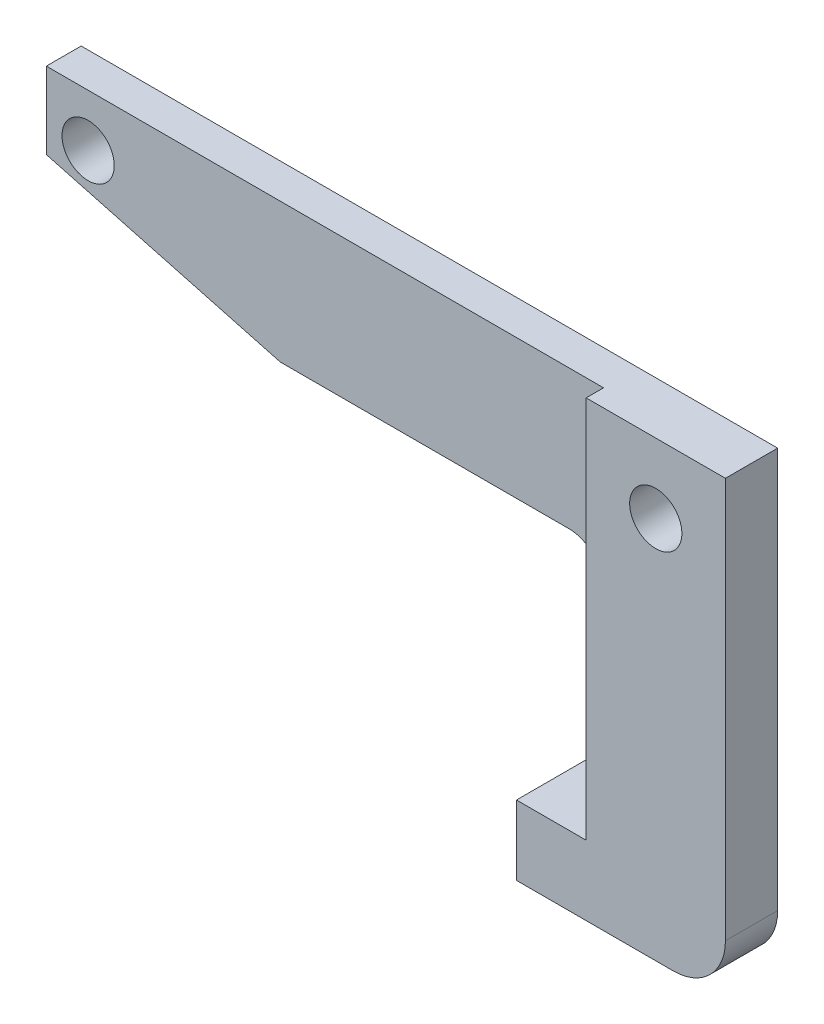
from build123d import *

# Parameters (mm, degrees)
BASE_EXTRUDE_DEPTH = 12.7
SKETCH2_R          = 4.7625
CUT_EXTRUDE1_DEPTH = 135.554087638
SKETCH3_R          = 4.7625
CUT_EXTRUDE2_DEPTH = 135.554087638
CHAMFER1_SIZE      = 11.43
CHAMFER1_SIZE2     = 42.657340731
SKETCH4_W          = 101.6
SKETCH4_H          = 25.4
CUT_EXTRUDE3_DEPTH = 3.175
FILLET1_R          = 9.525
FILLET2_R          = 6.35
CHAMFER2_SIZE      = 3.175
SKETCH5_R          = 9.525
CUT_EXTRUDE4_DEPTH = 4.445


with BuildPart() as part:
    # Sketch1 → Base-Extrude (new body)
    with BuildSketch(Plane.XY):
        Polygon((-114.3, 12.7), (12.7, 12.7), (12.7, -69.85), (-25.4, -69.85), (-25.4, -57.15), (-12.7, -57.15), (-12.7, -12.7), (-114.3, -12.7), align=None)
    extrude(amount=BASE_EXTRUDE_DEPTH)

    # Sketch2 → Cut-Extrude1 (cut, through all)
    with BuildSketch(Plane.XY.offset(12.7)):
        Circle(SKETCH2_R)
    extrude(amount=-CUT_EXTRUDE1_DEPTH, mode=Mode.SUBTRACT)

    # Sketch3 → Cut-Extrude2 (cut, through all)
    with BuildSketch(Plane.XY.offset(12.7)):
        with Locations((-106.68, 3.175)):
            Circle(SKETCH3_R)
    extrude(amount=-CUT_EXTRUDE2_DEPTH, mode=Mode.SUBTRACT)

    # Chamfer1
    chamfer1_edges = [part.edges().sort_by_distance(p)[0] for p in [
        (-114.3, -12.7, 6.35),
    ]]
    chamfer1_side = [part.faces().sort_by_distance(p)[0] for p in [
        (-114.3, 0, 6.35),
    ]]
    chamfer(chamfer1_edges, length=CHAMFER1_SIZE, length2=CHAMFER1_SIZE2, reference=chamfer1_side[0])

    # Sketch4 → Cut-Extrude3 (cut)
    with BuildSketch(Plane.XY.offset(12.7)):
        with Locations((-63.5, 0)):
            Rectangle(SKETCH4_W, SKETCH4_H)
    extrude(amount=-CUT_EXTRUDE3_DEPTH, mode=Mode.SUBTRACT)

    # Fillet1
    fillet1_edges = [part.edges().sort_by_distance(p)[0] for p in [
        (12.7, -69.85, 6.35),
    ]]
    fillet(fillet1_edges, radius=FILLET1_R)

    # Fillet2
    fillet2_edges = [part.edges().sort_by_distance(p)[0] for p in [
        (-12.7, -12.7, 4.7625),
    ]]
    fillet(fillet2_edges, radius=FILLET2_R)

    # Chamfer2
    chamfer2_edges = [part.edges().sort_by_distance(p)[0] for p in [
        (12.7, -23.8125, 0),
        (9.910192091, -67.060192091, 0),
        (-50.8, 12.7, 0),
        (-11.1125, -69.85, 0),
    ]]
    chamfer(chamfer2_edges, length=CHAMFER2_SIZE)

    # Sketch5 → Cut-Extrude4 (cut)
    with BuildSketch(Plane(origin=(0, 0, 0), x_dir=(-1, 0, 0), z_dir=(0, 0, -1))):
        Circle(SKETCH5_R)
    extrude(amount=-CUT_EXTRUDE4_DEPTH, mode=Mode.SUBTRACT)


solid = part.part
